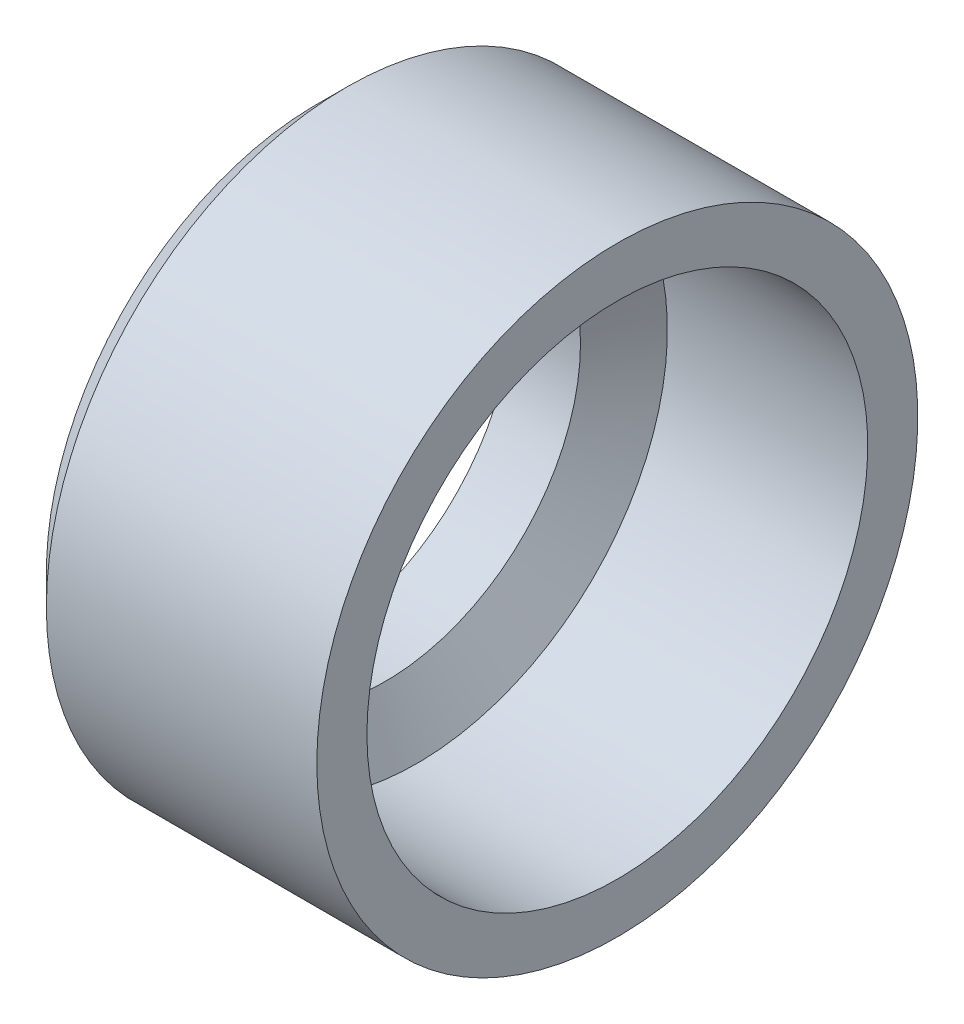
ISO-10303-21;
HEADER;
FILE_DESCRIPTION(('STEP AP214'),'2;1');
FILE_NAME('part.step','',(''),(''),'','','');
FILE_SCHEMA(('AUTOMOTIVE_DESIGN { 1 0 10303 214 1 1 1 1 }'));
ENDSEC;
DATA;
#1=APPLICATION_CONTEXT('core data for automotive mechanical design processes');
#2=APPLICATION_PROTOCOL_DEFINITION('international standard','automotive_design',2000,#1);
#3=PRODUCT_CONTEXT('',#1,'mechanical');
#4=PRODUCT('Part','Part','',(#3));
#5=PRODUCT_RELATED_PRODUCT_CATEGORY('part','',(#4));
#6=PRODUCT_DEFINITION_FORMATION('','',#4);
#7=PRODUCT_DEFINITION_CONTEXT('part definition',#1,'design');
#8=PRODUCT_DEFINITION('design','',#6,#7);
#9=PRODUCT_DEFINITION_SHAPE('','',#8);
#10=(LENGTH_UNIT() NAMED_UNIT(*) SI_UNIT(.MILLI.,.METRE.));
#11=(NAMED_UNIT(*) PLANE_ANGLE_UNIT() SI_UNIT($,.RADIAN.));
#12=(NAMED_UNIT(*) SI_UNIT($,.STERADIAN.) SOLID_ANGLE_UNIT());
#13=UNCERTAINTY_MEASURE_WITH_UNIT(LENGTH_MEASURE(1.E-05),#10,'distance_accuracy_value','');
#14=(GEOMETRIC_REPRESENTATION_CONTEXT(3) GLOBAL_UNCERTAINTY_ASSIGNED_CONTEXT((#13)) GLOBAL_UNIT_ASSIGNED_CONTEXT((#10,
#11,#12)) REPRESENTATION_CONTEXT('',''));
#15=CARTESIAN_POINT('',(0.,0.,0.));
#16=DIRECTION('',(0.,0.,1.));
#17=DIRECTION('',(1.,0.,0.));
#18=AXIS2_PLACEMENT_3D('',#15,#16,#17);
#19=CARTESIAN_POINT('',(0.,3.,0.));
#20=DIRECTION('',(1.,0.,0.));
#21=DIRECTION('',(0.,0.,-1.));
#22=AXIS2_PLACEMENT_3D('',#19,#20,#21);
#23=PLANE('',#22);
#24=CARTESIAN_POINT('',(0.,0.,0.));
#25=DIRECTION('',(1.,0.,0.));
#26=DIRECTION('',(0.,0.,-1.));
#27=AXIS2_PLACEMENT_3D('',#24,#25,#26);
#28=CIRCLE('',#27,2.7);
#29=CARTESIAN_POINT('',(0.,0.,-2.7));
#30=VERTEX_POINT('',#29);
#31=EDGE_CURVE('E37',#30,#30,#28,.F.);
#32=ORIENTED_EDGE('',*,*,#31,.T.);
#33=EDGE_LOOP('',(#32));
#34=FACE_BOUND('',#33,.T.);
#35=CARTESIAN_POINT('',(0.,0.,0.));
#36=DIRECTION('',(-1.,0.,0.));
#37=DIRECTION('',(0.,0.,1.));
#38=AXIS2_PLACEMENT_3D('',#35,#36,#37);
#39=CIRCLE('',#38,1.95);
#40=CARTESIAN_POINT('',(0.,0.,1.95));
#41=VERTEX_POINT('',#40);
#42=EDGE_CURVE('E41',#41,#41,#39,.T.);
#43=ORIENTED_EDGE('',*,*,#42,.F.);
#44=EDGE_LOOP('',(#43));
#45=FACE_BOUND('',#44,.T.);
#46=ADVANCED_FACE('F30',(#34,#45),#23,.F.);
#47=CARTESIAN_POINT('',(0.,0.,0.));
#48=DIRECTION('',(-1.,0.,0.));
#49=DIRECTION('',(0.,0.,1.));
#50=AXIS2_PLACEMENT_3D('',#47,#48,#49);
#51=CYLINDRICAL_SURFACE('',#50,1.95);
#52=CARTESIAN_POINT('',(0.682457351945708,0.,0.));
#53=DIRECTION('',(-1.,0.,0.));
#54=DIRECTION('',(0.,0.,1.));
#55=AXIS2_PLACEMENT_3D('',#52,#53,#54);
#56=CIRCLE('',#55,1.95);
#57=CARTESIAN_POINT('',(0.682457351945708,0.,1.95));
#58=VERTEX_POINT('',#57);
#59=EDGE_CURVE('E45',#58,#58,#56,.T.);
#60=ORIENTED_EDGE('',*,*,#59,.F.);
#61=EDGE_LOOP('',(#60));
#62=FACE_BOUND('',#61,.T.);
#63=ORIENTED_EDGE('',*,*,#42,.T.);
#64=EDGE_LOOP('',(#63));
#65=FACE_BOUND('',#64,.T.);
#66=ADVANCED_FACE('F77',(#62,#65),#51,.F.);
#67=CARTESIAN_POINT('',(0.682457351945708,0.,0.));
#68=DIRECTION('',(1.,0.,0.));
#69=DIRECTION('',(0.,0.,-1.));
#70=AXIS2_PLACEMENT_3D('',#67,#68,#69);
#71=CONICAL_SURFACE('',#70,1.95,1.0471975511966);
#72=CARTESIAN_POINT('',(1.,0.,0.));
#73=DIRECTION('',(-1.,0.,0.));
#74=DIRECTION('',(0.,0.,1.));
#75=AXIS2_PLACEMENT_3D('',#72,#73,#74);
#76=CIRCLE('',#75,2.5);
#77=CARTESIAN_POINT('',(1.,0.,2.5));
#78=VERTEX_POINT('',#77);
#79=EDGE_CURVE('E50',#78,#78,#76,.T.);
#80=ORIENTED_EDGE('',*,*,#79,.F.);
#81=EDGE_LOOP('',(#80));
#82=FACE_BOUND('',#81,.T.);
#83=ORIENTED_EDGE('',*,*,#59,.T.);
#84=EDGE_LOOP('',(#83));
#85=FACE_BOUND('',#84,.T.);
#86=ADVANCED_FACE('F71',(#82,#85),#71,.F.);
#87=CARTESIAN_POINT('',(0.,0.,0.));
#88=DIRECTION('',(-1.,0.,0.));
#89=DIRECTION('',(0.,0.,1.));
#90=AXIS2_PLACEMENT_3D('',#87,#88,#89);
#91=CYLINDRICAL_SURFACE('',#90,2.5);
#92=CARTESIAN_POINT('',(3.,0.,0.));
#93=DIRECTION('',(-1.,0.,0.));
#94=DIRECTION('',(0.,0.,1.));
#95=AXIS2_PLACEMENT_3D('',#92,#93,#94);
#96=CIRCLE('',#95,2.5);
#97=CARTESIAN_POINT('',(3.,0.,2.5));
#98=VERTEX_POINT('',#97);
#99=EDGE_CURVE('E53',#98,#98,#96,.T.);
#100=ORIENTED_EDGE('',*,*,#99,.F.);
#101=EDGE_LOOP('',(#100));
#102=FACE_BOUND('',#101,.T.);
#103=ORIENTED_EDGE('',*,*,#79,.T.);
#104=EDGE_LOOP('',(#103));
#105=FACE_BOUND('',#104,.T.);
#106=ADVANCED_FACE('F65',(#102,#105),#91,.F.);
#107=CARTESIAN_POINT('',(3.,2.5,0.));
#108=DIRECTION('',(-1.,0.,0.));
#109=DIRECTION('',(0.,0.,1.));
#110=AXIS2_PLACEMENT_3D('',#107,#108,#109);
#111=PLANE('',#110);
#112=CARTESIAN_POINT('',(3.,0.,0.));
#113=DIRECTION('',(-1.,0.,0.));
#114=DIRECTION('',(0.,0.,1.));
#115=AXIS2_PLACEMENT_3D('',#112,#113,#114);
#116=CIRCLE('',#115,3.);
#117=CARTESIAN_POINT('',(3.,0.,3.));
#118=VERTEX_POINT('',#117);
#119=EDGE_CURVE('E56',#118,#118,#116,.T.);
#120=ORIENTED_EDGE('',*,*,#119,.F.);
#121=EDGE_LOOP('',(#120));
#122=FACE_BOUND('',#121,.T.);
#123=ORIENTED_EDGE('',*,*,#99,.T.);
#124=EDGE_LOOP('',(#123));
#125=FACE_BOUND('',#124,.T.);
#126=ADVANCED_FACE('F62',(#122,#125),#111,.F.);
#127=CARTESIAN_POINT('',(0.,0.,0.));
#128=DIRECTION('',(-1.,0.,0.));
#129=DIRECTION('',(0.,0.,1.));
#130=AXIS2_PLACEMENT_3D('',#127,#128,#129);
#131=CYLINDRICAL_SURFACE('',#130,3.);
#132=CARTESIAN_POINT('',(0.300000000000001,0.,0.));
#133=DIRECTION('',(1.,0.,0.));
#134=DIRECTION('',(0.,0.,-1.));
#135=AXIS2_PLACEMENT_3D('',#132,#133,#134);
#136=CIRCLE('',#135,3.);
#137=CARTESIAN_POINT('',(0.300000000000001,0.,-3.));
#138=VERTEX_POINT('',#137);
#139=EDGE_CURVE('E10',#138,#138,#136,.T.);
#140=ORIENTED_EDGE('',*,*,#139,.T.);
#141=EDGE_LOOP('',(#140));
#142=FACE_BOUND('',#141,.T.);
#143=ORIENTED_EDGE('',*,*,#119,.T.);
#144=EDGE_LOOP('',(#143));
#145=FACE_BOUND('',#144,.T.);
#146=ADVANCED_FACE('F60',(#142,#145),#131,.T.);
#147=CARTESIAN_POINT('',(0.,0.,0.));
#148=DIRECTION('',(1.,0.,0.));
#149=DIRECTION('',(0.,0.,-1.));
#150=AXIS2_PLACEMENT_3D('',#147,#148,#149);
#151=CONICAL_SURFACE('',#150,2.7,0.785398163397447);
#152=ORIENTED_EDGE('',*,*,#139,.F.);
#153=EDGE_LOOP('',(#152));
#154=FACE_BOUND('',#153,.T.);
#155=ORIENTED_EDGE('',*,*,#31,.F.);
#156=EDGE_LOOP('',(#155));
#157=FACE_BOUND('',#156,.T.);
#158=ADVANCED_FACE('F32',(#154,#157),#151,.T.);
#159=CLOSED_SHELL('',(#46,#66,#86,#106,#126,#146,#158));
#160=MANIFOLD_SOLID_BREP('B2',#159);
#161=ADVANCED_BREP_SHAPE_REPRESENTATION('',(#18,#160),#14);
#162=SHAPE_DEFINITION_REPRESENTATION(#9,#161);
ENDSEC;
END-ISO-10303-21;
